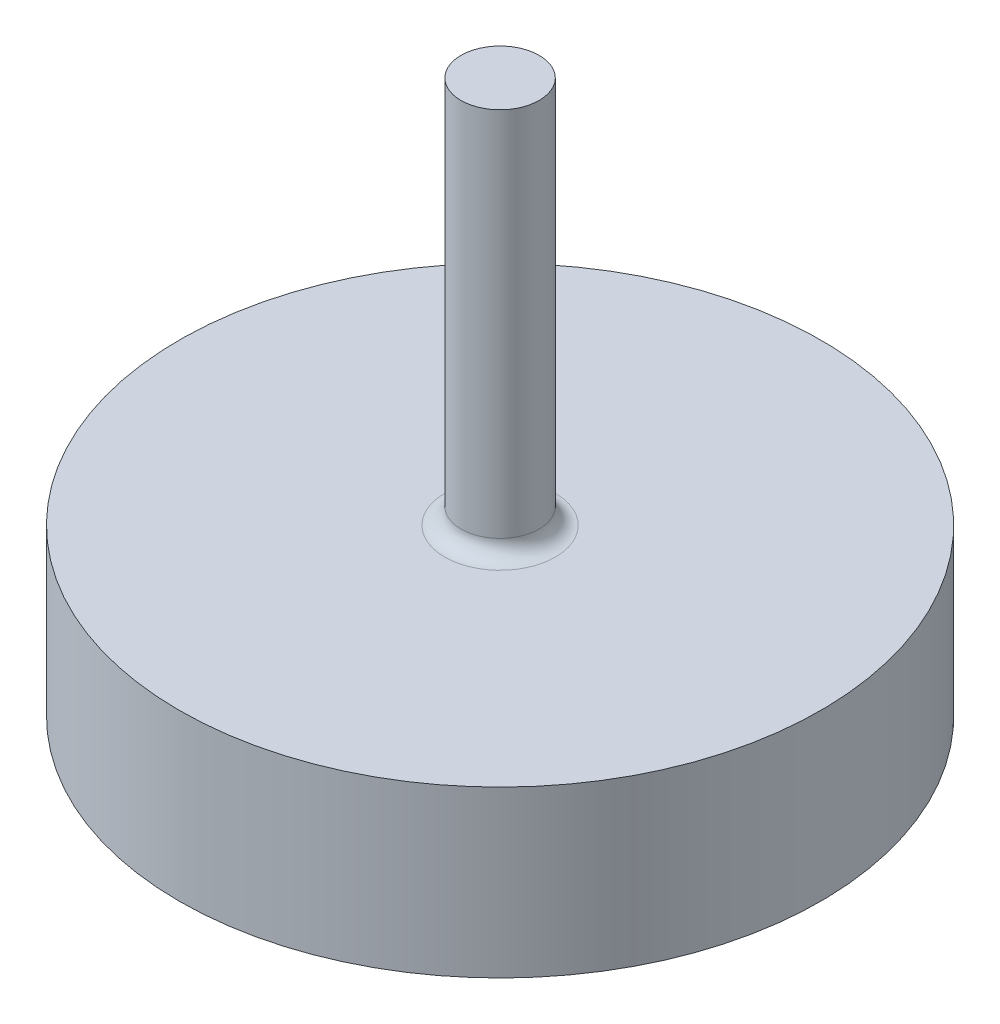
ISO-10303-21;
HEADER;
FILE_DESCRIPTION(('STEP AP214'),'2;1');
FILE_NAME('part.step','',(''),(''),'','','');
FILE_SCHEMA(('AUTOMOTIVE_DESIGN { 1 0 10303 214 1 1 1 1 }'));
ENDSEC;
DATA;
#1=APPLICATION_CONTEXT('core data for automotive mechanical design processes');
#2=APPLICATION_PROTOCOL_DEFINITION('international standard','automotive_design',2000,#1);
#3=PRODUCT_CONTEXT('',#1,'mechanical');
#4=PRODUCT('Part','Part','',(#3));
#5=PRODUCT_RELATED_PRODUCT_CATEGORY('part','',(#4));
#6=PRODUCT_DEFINITION_FORMATION('','',#4);
#7=PRODUCT_DEFINITION_CONTEXT('part definition',#1,'design');
#8=PRODUCT_DEFINITION('design','',#6,#7);
#9=PRODUCT_DEFINITION_SHAPE('','',#8);
#10=(LENGTH_UNIT() NAMED_UNIT(*) SI_UNIT(.MILLI.,.METRE.));
#11=(NAMED_UNIT(*) PLANE_ANGLE_UNIT() SI_UNIT($,.RADIAN.));
#12=(NAMED_UNIT(*) SI_UNIT($,.STERADIAN.) SOLID_ANGLE_UNIT());
#13=UNCERTAINTY_MEASURE_WITH_UNIT(LENGTH_MEASURE(1.E-05),#10,'distance_accuracy_value','');
#14=(GEOMETRIC_REPRESENTATION_CONTEXT(3) GLOBAL_UNCERTAINTY_ASSIGNED_CONTEXT((#13)) GLOBAL_UNIT_ASSIGNED_CONTEXT((#10,
#11,#12)) REPRESENTATION_CONTEXT('',''));
#15=CARTESIAN_POINT('',(0.,0.,0.));
#16=DIRECTION('',(0.,0.,1.));
#17=DIRECTION('',(1.,0.,0.));
#18=AXIS2_PLACEMENT_3D('',#15,#16,#17);
#19=CARTESIAN_POINT('',(-3.06069999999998,0.,0.));
#20=DIRECTION('',(0.,1.,0.));
#21=DIRECTION('',(0.,0.,0.999999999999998));
#22=AXIS2_PLACEMENT_3D('',#19,#20,#21);
#23=PLANE('',#22);
#24=CARTESIAN_POINT('',(0.,0.,0.));
#25=DIRECTION('',(0.,1.,0.));
#26=DIRECTION('',(0.,0.,0.999999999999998));
#27=AXIS2_PLACEMENT_3D('',#24,#25,#26);
#28=CIRCLE('',#27,3.0607);
#29=CARTESIAN_POINT('',(0.,0.,3.06069999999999));
#30=VERTEX_POINT('',#29);
#31=EDGE_CURVE('E64',#30,#30,#28,.T.);
#32=ORIENTED_EDGE('',*,*,#31,.T.);
#33=EDGE_LOOP('',(#32));
#34=FACE_BOUND('',#33,.T.);
#35=ADVANCED_FACE('F44',(#34),#23,.T.);
#36=CARTESIAN_POINT('',(0.,-43.3070000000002,0.));
#37=DIRECTION('',(0.,-1.,0.));
#38=DIRECTION('',(0.,0.,-0.999999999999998));
#39=AXIS2_PLACEMENT_3D('',#36,#37,#38);
#40=PLANE('',#39);
#41=CARTESIAN_POINT('',(0.,-43.3070000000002,0.));
#42=DIRECTION('',(0.,1.,0.));
#43=DIRECTION('',(0.,0.,0.999999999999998));
#44=AXIS2_PLACEMENT_3D('',#41,#42,#43);
#45=CIRCLE('',#44,25.1333);
#46=CARTESIAN_POINT('',(0.,-43.3070000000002,25.1332999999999));
#47=VERTEX_POINT('',#46);
#48=EDGE_CURVE('E55',#47,#47,#45,.T.);
#49=ORIENTED_EDGE('',*,*,#48,.F.);
#50=EDGE_LOOP('',(#49));
#51=FACE_BOUND('',#50,.T.);
#52=ADVANCED_FACE('F81',(#51),#40,.T.);
#53=CARTESIAN_POINT('',(0.,34.9964898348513,0.));
#54=DIRECTION('',(0.,1.,0.));
#55=DIRECTION('',(0.,0.,0.999999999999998));
#56=AXIS2_PLACEMENT_3D('',#53,#54,#55);
#57=CYLINDRICAL_SURFACE('',#56,25.1333);
#58=ORIENTED_EDGE('',*,*,#48,.T.);
#59=EDGE_LOOP('',(#58));
#60=FACE_BOUND('',#59,.T.);
#61=CARTESIAN_POINT('',(0.,-30.353,0.));
#62=DIRECTION('',(0.,1.,0.));
#63=DIRECTION('',(0.,0.,0.999999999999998));
#64=AXIS2_PLACEMENT_3D('',#61,#62,#63);
#65=CIRCLE('',#64,25.1333);
#66=CARTESIAN_POINT('',(0.,-30.353,25.1332999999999));
#67=VERTEX_POINT('',#66);
#68=EDGE_CURVE('E59',#67,#67,#65,.T.);
#69=ORIENTED_EDGE('',*,*,#68,.F.);
#70=EDGE_LOOP('',(#69));
#71=FACE_BOUND('',#70,.T.);
#72=ADVANCED_FACE('F78',(#60,#71),#57,.T.);
#73=CARTESIAN_POINT('',(-25.1332999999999,-30.353,0.));
#74=DIRECTION('',(0.,1.,0.));
#75=DIRECTION('',(0.,0.,0.999999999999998));
#76=AXIS2_PLACEMENT_3D('',#73,#74,#75);
#77=PLANE('',#76);
#78=CARTESIAN_POINT('',(0.,-30.353,0.));
#79=DIRECTION('',(0.,1.,0.));
#80=DIRECTION('',(0.,0.,0.999999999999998));
#81=AXIS2_PLACEMENT_3D('',#78,#79,#80);
#82=CIRCLE('',#81,4.3307);
#83=CARTESIAN_POINT('',(0.,-30.353,4.33069999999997));
#84=VERTEX_POINT('',#83);
#85=EDGE_CURVE('E12',#84,#84,#82,.F.);
#86=ORIENTED_EDGE('',*,*,#85,.T.);
#87=EDGE_LOOP('',(#86));
#88=FACE_BOUND('',#87,.T.);
#89=ORIENTED_EDGE('',*,*,#68,.T.);
#90=EDGE_LOOP('',(#89));
#91=FACE_BOUND('',#90,.T.);
#92=ADVANCED_FACE('F71',(#88,#91),#77,.T.);
#93=CARTESIAN_POINT('',(0.,34.9964898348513,0.));
#94=DIRECTION('',(0.,1.,0.));
#95=DIRECTION('',(0.,0.,0.999999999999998));
#96=AXIS2_PLACEMENT_3D('',#93,#94,#95);
#97=CYLINDRICAL_SURFACE('',#96,3.0607);
#98=CARTESIAN_POINT('',(0.,-29.0829999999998,0.));
#99=DIRECTION('',(0.,1.,0.));
#100=DIRECTION('',(0.,0.,0.999999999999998));
#101=AXIS2_PLACEMENT_3D('',#98,#99,#100);
#102=CIRCLE('',#101,3.0607);
#103=CARTESIAN_POINT('',(0.,-29.0829999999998,3.06069999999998));
#104=VERTEX_POINT('',#103);
#105=EDGE_CURVE('E51',#104,#104,#102,.T.);
#106=ORIENTED_EDGE('',*,*,#105,.T.);
#107=EDGE_LOOP('',(#106));
#108=FACE_BOUND('',#107,.T.);
#109=ORIENTED_EDGE('',*,*,#31,.F.);
#110=EDGE_LOOP('',(#109));
#111=FACE_BOUND('',#110,.T.);
#112=ADVANCED_FACE('F69',(#108,#111),#97,.T.);
#113=CARTESIAN_POINT('',(0.,-29.0829999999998,0.));
#114=DIRECTION('',(0.,1.,0.));
#115=DIRECTION('',(0.,0.,0.999999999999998));
#116=AXIS2_PLACEMENT_3D('',#113,#114,#115);
#117=TOROIDAL_SURFACE('',#116,4.3307,1.27);
#118=ORIENTED_EDGE('',*,*,#85,.F.);
#119=EDGE_LOOP('',(#118));
#120=FACE_BOUND('',#119,.T.);
#121=ORIENTED_EDGE('',*,*,#105,.F.);
#122=EDGE_LOOP('',(#121));
#123=FACE_BOUND('',#122,.T.);
#124=ADVANCED_FACE('F46',(#120,#123),#117,.F.);
#125=CLOSED_SHELL('',(#35,#52,#72,#92,#112,#124));
#126=MANIFOLD_SOLID_BREP('B2',#125);
#127=ADVANCED_BREP_SHAPE_REPRESENTATION('',(#18,#126),#14);
#128=SHAPE_DEFINITION_REPRESENTATION(#9,#127);
ENDSEC;
END-ISO-10303-21;
